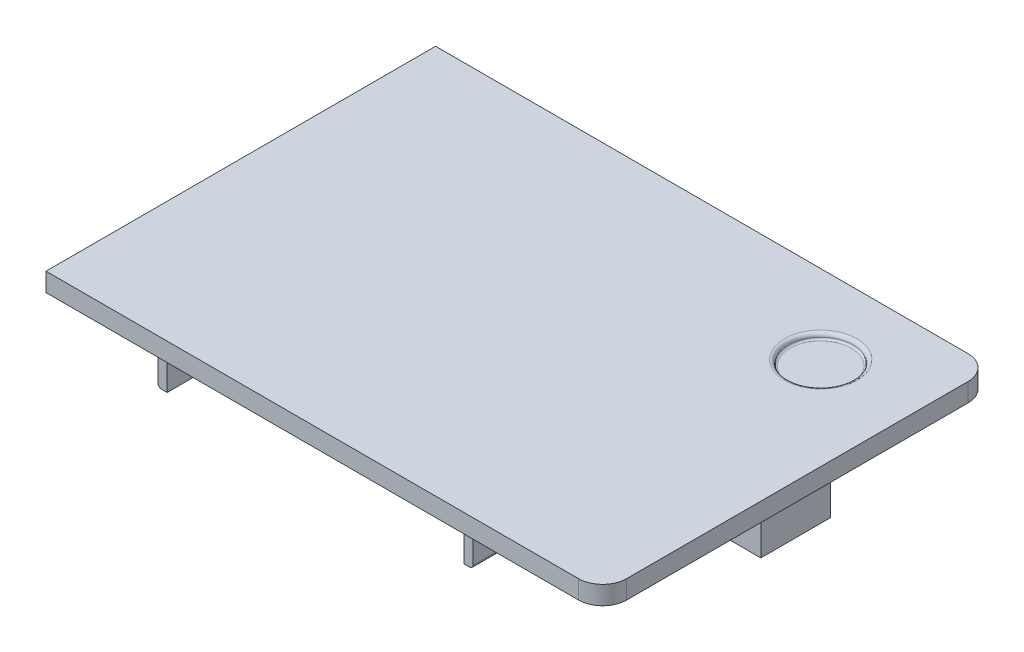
ISO-10303-21;
HEADER;
FILE_DESCRIPTION(('STEP AP214'),'2;1');
FILE_NAME('part.step','',(''),(''),'','','');
FILE_SCHEMA(('AUTOMOTIVE_DESIGN { 1 0 10303 214 1 1 1 1 }'));
ENDSEC;
DATA;
#1=APPLICATION_CONTEXT('core data for automotive mechanical design processes');
#2=APPLICATION_PROTOCOL_DEFINITION('international standard','automotive_design',2000,#1);
#3=PRODUCT_CONTEXT('',#1,'mechanical');
#4=PRODUCT('Part','Part','',(#3));
#5=PRODUCT_RELATED_PRODUCT_CATEGORY('part','',(#4));
#6=PRODUCT_DEFINITION_FORMATION('','',#4);
#7=PRODUCT_DEFINITION_CONTEXT('part definition',#1,'design');
#8=PRODUCT_DEFINITION('design','',#6,#7);
#9=PRODUCT_DEFINITION_SHAPE('','',#8);
#10=(LENGTH_UNIT() NAMED_UNIT(*) SI_UNIT(.MILLI.,.METRE.));
#11=(NAMED_UNIT(*) PLANE_ANGLE_UNIT() SI_UNIT($,.RADIAN.));
#12=(NAMED_UNIT(*) SI_UNIT($,.STERADIAN.) SOLID_ANGLE_UNIT());
#13=UNCERTAINTY_MEASURE_WITH_UNIT(LENGTH_MEASURE(1.E-05),#10,'distance_accuracy_value','');
#14=(GEOMETRIC_REPRESENTATION_CONTEXT(3) GLOBAL_UNCERTAINTY_ASSIGNED_CONTEXT((#13)) GLOBAL_UNIT_ASSIGNED_CONTEXT((#10,
#11,#12)) REPRESENTATION_CONTEXT('',''));
#15=CARTESIAN_POINT('',(0.,0.,0.));
#16=DIRECTION('',(0.,0.,1.));
#17=DIRECTION('',(1.,0.,0.));
#18=AXIS2_PLACEMENT_3D('',#15,#16,#17);
#19=CARTESIAN_POINT('',(-230.407229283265,-38.1,266.7));
#20=DIRECTION('',(1.,0.,0.));
#21=DIRECTION('',(0.,0.,-1.));
#22=AXIS2_PLACEMENT_3D('',#19,#20,#21);
#23=PLANE('',#22);
#24=DIRECTION('',(0.,-1.,0.));
#25=VECTOR('',#24,1.);
#26=CARTESIAN_POINT('',(-230.407229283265,0.,264.16));
#27=LINE('',#26,#25);
#28=CARTESIAN_POINT('',(-230.407229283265,0.,264.16));
#29=VERTEX_POINT('',#28);
#30=CARTESIAN_POINT('',(-230.407229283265,-33.02,264.16));
#31=VERTEX_POINT('',#30);
#32=EDGE_CURVE('E487',#29,#31,#27,.T.);
#33=ORIENTED_EDGE('',*,*,#32,.F.);
#34=DIRECTION('',(0.,0.,-1.));
#35=VECTOR('',#34,1.);
#36=CARTESIAN_POINT('',(-230.407229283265,0.,266.7));
#37=LINE('',#36,#35);
#38=CARTESIAN_POINT('',(-230.407229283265,0.,106.68));
#39=VERTEX_POINT('',#38);
#40=EDGE_CURVE('E266',#29,#39,#37,.T.);
#41=ORIENTED_EDGE('',*,*,#40,.T.);
#42=DIRECTION('',(0.,1.,0.));
#43=VECTOR('',#42,1.);
#44=CARTESIAN_POINT('',(-230.407229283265,-38.1,106.68));
#45=LINE('',#44,#43);
#46=CARTESIAN_POINT('',(-230.407229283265,-33.02,106.68));
#47=VERTEX_POINT('',#46);
#48=EDGE_CURVE('E350',#39,#47,#45,.F.);
#49=ORIENTED_EDGE('',*,*,#48,.T.);
#50=DIRECTION('',(0.,0.,-1.));
#51=VECTOR('',#50,1.);
#52=CARTESIAN_POINT('',(-230.407229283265,-33.02,266.7));
#53=LINE('',#52,#51);
#54=EDGE_CURVE('E347',#47,#31,#53,.F.);
#55=ORIENTED_EDGE('',*,*,#54,.T.);
#56=EDGE_LOOP('',(#33,#41,#49,#55));
#57=FACE_BOUND('',#56,.T.);
#58=ADVANCED_FACE('F37',(#57),#23,.F.);
#59=CARTESIAN_POINT('',(201.392770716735,-38.1,101.6));
#60=DIRECTION('',(-1.,0.,0.));
#61=DIRECTION('',(0.,0.,1.));
#62=AXIS2_PLACEMENT_3D('',#59,#60,#61);
#63=PLANE('',#62);
#64=DIRECTION('',(0.,1.,0.));
#65=VECTOR('',#64,1.);
#66=CARTESIAN_POINT('',(201.392770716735,-33.02,264.16));
#67=LINE('',#66,#65);
#68=CARTESIAN_POINT('',(201.392770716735,-33.02,264.16));
#69=VERTEX_POINT('',#68);
#70=CARTESIAN_POINT('',(201.392770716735,0.,264.16));
#71=VERTEX_POINT('',#70);
#72=EDGE_CURVE('E483',#69,#71,#67,.T.);
#73=ORIENTED_EDGE('',*,*,#72,.F.);
#74=DIRECTION('',(0.,0.,1.));
#75=VECTOR('',#74,1.);
#76=CARTESIAN_POINT('',(201.392770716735,-33.02,101.6));
#77=LINE('',#76,#75);
#78=CARTESIAN_POINT('',(201.392770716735,-33.02,106.68));
#79=VERTEX_POINT('',#78);
#80=EDGE_CURVE('E352',#69,#79,#77,.F.);
#81=ORIENTED_EDGE('',*,*,#80,.T.);
#82=DIRECTION('',(0.,1.,0.));
#83=VECTOR('',#82,1.);
#84=CARTESIAN_POINT('',(201.392770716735,-38.1,106.68));
#85=LINE('',#84,#83);
#86=CARTESIAN_POINT('',(201.392770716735,0.,106.68));
#87=VERTEX_POINT('',#86);
#88=EDGE_CURVE('E354',#79,#87,#85,.T.);
#89=ORIENTED_EDGE('',*,*,#88,.T.);
#90=DIRECTION('',(0.,0.,1.));
#91=VECTOR('',#90,1.);
#92=CARTESIAN_POINT('',(201.392770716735,0.,101.6));
#93=LINE('',#92,#91);
#94=EDGE_CURVE('E272',#87,#71,#93,.T.);
#95=ORIENTED_EDGE('',*,*,#94,.T.);
#96=EDGE_LOOP('',(#73,#81,#89,#95));
#97=FACE_BOUND('',#96,.T.);
#98=ADVANCED_FACE('F551',(#97),#63,.F.);
#99=CARTESIAN_POINT('',(188.692770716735,-38.1,114.3));
#100=DIRECTION('',(1.,0.,0.));
#101=DIRECTION('',(0.,0.,-1.));
#102=AXIS2_PLACEMENT_3D('',#99,#100,#101);
#103=PLANE('',#102);
#104=DIRECTION('',(0.,-1.,0.));
#105=VECTOR('',#104,1.);
#106=CARTESIAN_POINT('',(188.692770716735,0.,264.16));
#107=LINE('',#106,#105);
#108=CARTESIAN_POINT('',(188.692770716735,0.,264.16));
#109=VERTEX_POINT('',#108);
#110=CARTESIAN_POINT('',(188.692770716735,-38.1,264.16));
#111=VERTEX_POINT('',#110);
#112=EDGE_CURVE('E477',#109,#111,#107,.T.);
#113=ORIENTED_EDGE('',*,*,#112,.F.);
#114=DIRECTION('',(0.,0.,-1.));
#115=VECTOR('',#114,1.);
#116=CARTESIAN_POINT('',(188.692770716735,0.,114.3));
#117=LINE('',#116,#115);
#118=CARTESIAN_POINT('',(188.692770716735,0.,114.3));
#119=VERTEX_POINT('',#118);
#120=EDGE_CURVE('E275',#109,#119,#117,.T.);
#121=ORIENTED_EDGE('',*,*,#120,.T.);
#122=DIRECTION('',(0.,1.,0.));
#123=VECTOR('',#122,1.);
#124=CARTESIAN_POINT('',(188.692770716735,-38.1,114.3));
#125=LINE('',#124,#123);
#126=CARTESIAN_POINT('',(188.692770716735,-38.1,114.3));
#127=VERTEX_POINT('',#126);
#128=EDGE_CURVE('E284',#127,#119,#125,.T.);
#129=ORIENTED_EDGE('',*,*,#128,.F.);
#130=DIRECTION('',(0.,0.,-1.));
#131=VECTOR('',#130,1.);
#132=CARTESIAN_POINT('',(188.692770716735,-38.1,114.3));
#133=LINE('',#132,#131);
#134=EDGE_CURVE('E257',#111,#127,#133,.T.);
#135=ORIENTED_EDGE('',*,*,#134,.F.);
#136=EDGE_LOOP('',(#113,#121,#129,#135));
#137=FACE_BOUND('',#136,.T.);
#138=ADVANCED_FACE('F553',(#137),#103,.F.);
#139=CARTESIAN_POINT('',(-217.707229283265,-38.1,266.7));
#140=DIRECTION('',(-1.,0.,0.));
#141=DIRECTION('',(0.,0.,1.));
#142=AXIS2_PLACEMENT_3D('',#139,#140,#141);
#143=PLANE('',#142);
#144=DIRECTION('',(0.,1.,0.));
#145=VECTOR('',#144,1.);
#146=CARTESIAN_POINT('',(-217.707229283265,-38.1,264.16));
#147=LINE('',#146,#145);
#148=CARTESIAN_POINT('',(-217.707229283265,-38.1,264.16));
#149=VERTEX_POINT('',#148);
#150=CARTESIAN_POINT('',(-217.707229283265,0.,264.16));
#151=VERTEX_POINT('',#150);
#152=EDGE_CURVE('E471',#149,#151,#147,.T.);
#153=ORIENTED_EDGE('',*,*,#152,.F.);
#154=DIRECTION('',(0.,0.,1.));
#155=VECTOR('',#154,1.);
#156=CARTESIAN_POINT('',(-217.707229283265,-38.1,266.7));
#157=LINE('',#156,#155);
#158=CARTESIAN_POINT('',(-217.707229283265,-38.1,114.3));
#159=VERTEX_POINT('',#158);
#160=EDGE_CURVE('E262',#159,#149,#157,.T.);
#161=ORIENTED_EDGE('',*,*,#160,.F.);
#162=DIRECTION('',(0.,1.,0.));
#163=VECTOR('',#162,1.);
#164=CARTESIAN_POINT('',(-217.707229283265,-38.1,114.3));
#165=LINE('',#164,#163);
#166=CARTESIAN_POINT('',(-217.707229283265,0.,114.3));
#167=VERTEX_POINT('',#166);
#168=EDGE_CURVE('E265',#159,#167,#165,.T.);
#169=ORIENTED_EDGE('',*,*,#168,.T.);
#170=DIRECTION('',(0.,0.,1.));
#171=VECTOR('',#170,1.);
#172=CARTESIAN_POINT('',(-217.707229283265,0.,266.7));
#173=LINE('',#172,#171);
#174=EDGE_CURVE('E260',#167,#151,#173,.T.);
#175=ORIENTED_EDGE('',*,*,#174,.T.);
#176=EDGE_LOOP('',(#153,#161,#169,#175));
#177=FACE_BOUND('',#176,.T.);
#178=ADVANCED_FACE('F499',(#177),#143,.F.);
#179=CARTESIAN_POINT('',(0.,-38.1,0.));
#180=DIRECTION('',(0.,1.,0.));
#181=DIRECTION('',(0.,0.,1.));
#182=AXIS2_PLACEMENT_3D('',#179,#180,#181);
#183=PLANE('',#182);
#184=DIRECTION('',(1.,0.,0.));
#185=VECTOR('',#184,1.);
#186=CARTESIAN_POINT('',(188.692770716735,-38.1,264.16));
#187=LINE('',#186,#185);
#188=CARTESIAN_POINT('',(196.312770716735,-38.1,264.16));
#189=VERTEX_POINT('',#188);
#190=EDGE_CURVE('E65',#111,#189,#187,.T.);
#191=ORIENTED_EDGE('',*,*,#190,.F.);
#192=ORIENTED_EDGE('',*,*,#134,.T.);
#193=DIRECTION('',(-1.,0.,0.));
#194=VECTOR('',#193,1.);
#195=CARTESIAN_POINT('',(-217.707229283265,-38.1,114.3));
#196=LINE('',#195,#194);
#197=EDGE_CURVE('E259',#127,#159,#196,.T.);
#198=ORIENTED_EDGE('',*,*,#197,.T.);
#199=ORIENTED_EDGE('',*,*,#160,.T.);
#200=DIRECTION('',(1.,0.,0.));
#201=VECTOR('',#200,1.);
#202=CARTESIAN_POINT('',(-225.327229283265,-38.1,264.16));
#203=LINE('',#202,#201);
#204=CARTESIAN_POINT('',(-225.327229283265,-38.1,264.16));
#205=VERTEX_POINT('',#204);
#206=EDGE_CURVE('E479',#205,#149,#203,.T.);
#207=ORIENTED_EDGE('',*,*,#206,.F.);
#208=DIRECTION('',(0.,0.,-1.));
#209=VECTOR('',#208,1.);
#210=CARTESIAN_POINT('',(-225.327229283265,-38.1,0.));
#211=LINE('',#210,#209);
#212=CARTESIAN_POINT('',(-225.327229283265,-38.1,106.68));
#213=VERTEX_POINT('',#212);
#214=EDGE_CURVE('E361',#205,#213,#211,.T.);
#215=ORIENTED_EDGE('',*,*,#214,.T.);
#216=DIRECTION('',(1.,0.,0.));
#217=VECTOR('',#216,1.);
#218=CARTESIAN_POINT('',(0.,-38.1,106.68));
#219=LINE('',#218,#217);
#220=CARTESIAN_POINT('',(196.312770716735,-38.1,106.68));
#221=VERTEX_POINT('',#220);
#222=EDGE_CURVE('E359',#213,#221,#219,.T.);
#223=ORIENTED_EDGE('',*,*,#222,.T.);
#224=DIRECTION('',(0.,0.,1.));
#225=VECTOR('',#224,1.);
#226=CARTESIAN_POINT('',(196.312770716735,-38.1,0.));
#227=LINE('',#226,#225);
#228=EDGE_CURVE('E356',#221,#189,#227,.T.);
#229=ORIENTED_EDGE('',*,*,#228,.T.);
#230=EDGE_LOOP('',(#191,#192,#198,#199,#207,#215,#223,#229));
#231=FACE_BOUND('',#230,.T.);
#232=ADVANCED_FACE('F500',(#231),#183,.F.);
#233=CARTESIAN_POINT('',(196.312770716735,-33.02,0.));
#234=DIRECTION('',(0.,0.,1.));
#235=DIRECTION('',(1.,0.,0.));
#236=AXIS2_PLACEMENT_3D('',#233,#234,#235);
#237=CYLINDRICAL_SURFACE('',#236,5.08);
#238=ORIENTED_EDGE('',*,*,#80,.F.);
#239=CARTESIAN_POINT('',(196.312770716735,-33.02,264.16));
#240=DIRECTION('',(0.,0.,1.));
#241=DIRECTION('',(1.,0.,0.));
#242=AXIS2_PLACEMENT_3D('',#239,#240,#241);
#243=CIRCLE('',#242,5.08000000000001);
#244=EDGE_CURVE('E481',#189,#69,#243,.T.);
#245=ORIENTED_EDGE('',*,*,#244,.F.);
#246=ORIENTED_EDGE('',*,*,#228,.F.);
#247=CARTESIAN_POINT('',(196.312770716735,-33.02,106.68));
#248=DIRECTION('',(0.,0.,-1.));
#249=DIRECTION('',(-1.,0.,0.));
#250=AXIS2_PLACEMENT_3D('',#247,#248,#249);
#251=CIRCLE('',#250,5.08);
#252=EDGE_CURVE('E269',#79,#221,#251,.T.);
#253=ORIENTED_EDGE('',*,*,#252,.F.);
#254=EDGE_LOOP('',(#238,#245,#246,#253));
#255=FACE_BOUND('',#254,.T.);
#256=ADVANCED_FACE('F547',(#255),#237,.T.);
#257=CARTESIAN_POINT('',(-225.327229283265,-33.02,0.));
#258=DIRECTION('',(0.,0.,-1.));
#259=DIRECTION('',(-1.,0.,0.));
#260=AXIS2_PLACEMENT_3D('',#257,#258,#259);
#261=CYLINDRICAL_SURFACE('',#260,5.08);
#262=ORIENTED_EDGE('',*,*,#214,.F.);
#263=CARTESIAN_POINT('',(-225.327229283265,-33.02,264.16));
#264=DIRECTION('',(0.,0.,1.));
#265=DIRECTION('',(1.,0.,0.));
#266=AXIS2_PLACEMENT_3D('',#263,#264,#265);
#267=CIRCLE('',#266,5.07999999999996);
#268=EDGE_CURVE('E489',#31,#205,#267,.T.);
#269=ORIENTED_EDGE('',*,*,#268,.F.);
#270=ORIENTED_EDGE('',*,*,#54,.F.);
#271=CARTESIAN_POINT('',(-225.327229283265,-33.02,106.68));
#272=DIRECTION('',(0.,0.,-1.));
#273=DIRECTION('',(-1.,0.,0.));
#274=AXIS2_PLACEMENT_3D('',#271,#272,#273);
#275=CIRCLE('',#274,5.08);
#276=EDGE_CURVE('E374',#213,#47,#275,.T.);
#277=ORIENTED_EDGE('',*,*,#276,.F.);
#278=EDGE_LOOP('',(#262,#269,#270,#277));
#279=FACE_BOUND('',#278,.T.);
#280=ADVANCED_FACE('F518',(#279),#261,.T.);
#281=CARTESIAN_POINT('',(0.,0.,0.));
#282=DIRECTION('',(0.,-1.,0.));
#283=DIRECTION('',(0.,0.,-1.));
#284=AXIS2_PLACEMENT_3D('',#281,#282,#283);
#285=PLANE('',#284);
#286=DIRECTION('',(-1.,0.,0.));
#287=VECTOR('',#286,1.);
#288=CARTESIAN_POINT('',(381.,0.,47.5173340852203));
#289=LINE('',#288,#287);
#290=CARTESIAN_POINT('',(378.46,0.,47.5173340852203));
#291=VERTEX_POINT('',#290);
#292=CARTESIAN_POINT('',(-342.9,0.,47.5173340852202));
#293=VERTEX_POINT('',#292);
#294=EDGE_CURVE('E247',#291,#293,#289,.T.);
#295=ORIENTED_EDGE('',*,*,#294,.F.);
#296=DIRECTION('',(0.,0.,1.));
#297=VECTOR('',#296,1.);
#298=CARTESIAN_POINT('',(378.46,0.,47.5173340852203));
#299=LINE('',#298,#297);
#300=CARTESIAN_POINT('',(378.46,0.,-47.7326659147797));
#301=VERTEX_POINT('',#300);
#302=EDGE_CURVE('E233',#301,#291,#299,.T.);
#303=ORIENTED_EDGE('',*,*,#302,.F.);
#304=DIRECTION('',(1.,0.,0.));
#305=VECTOR('',#304,1.);
#306=CARTESIAN_POINT('',(381.,0.,-47.7326659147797));
#307=LINE('',#306,#305);
#308=CARTESIAN_POINT('',(-342.9,0.,-47.7326659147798));
#309=VERTEX_POINT('',#308);
#310=EDGE_CURVE('E232',#309,#301,#307,.T.);
#311=ORIENTED_EDGE('',*,*,#310,.F.);
#312=DIRECTION('',(0.,0.,-1.));
#313=VECTOR('',#312,1.);
#314=CARTESIAN_POINT('',(-342.9,0.,47.5173340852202));
#315=LINE('',#314,#313);
#316=EDGE_CURVE('E249',#293,#309,#315,.T.);
#317=ORIENTED_EDGE('',*,*,#316,.F.);
#318=EDGE_LOOP('',(#295,#303,#311,#317));
#319=FACE_BOUND('',#318,.T.);
#320=ORIENTED_EDGE('',*,*,#40,.F.);
#321=DIRECTION('',(-1.,0.,0.));
#322=VECTOR('',#321,1.);
#323=CARTESIAN_POINT('',(-217.707229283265,0.,264.16));
#324=LINE('',#323,#322);
#325=EDGE_CURVE('E474',#151,#29,#324,.T.);
#326=ORIENTED_EDGE('',*,*,#325,.F.);
#327=ORIENTED_EDGE('',*,*,#174,.F.);
#328=DIRECTION('',(-1.,0.,0.));
#329=VECTOR('',#328,1.);
#330=CARTESIAN_POINT('',(-217.707229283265,0.,114.3));
#331=LINE('',#330,#329);
#332=EDGE_CURVE('E277',#119,#167,#331,.T.);
#333=ORIENTED_EDGE('',*,*,#332,.F.);
#334=ORIENTED_EDGE('',*,*,#120,.F.);
#335=DIRECTION('',(-1.,0.,0.));
#336=VECTOR('',#335,1.);
#337=CARTESIAN_POINT('',(188.692770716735,0.,264.16));
#338=LINE('',#337,#336);
#339=EDGE_CURVE('E414',#71,#109,#338,.T.);
#340=ORIENTED_EDGE('',*,*,#339,.F.);
#341=ORIENTED_EDGE('',*,*,#94,.F.);
#342=CARTESIAN_POINT('',(196.312770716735,0.,106.68));
#343=DIRECTION('',(0.,-1.,0.));
#344=DIRECTION('',(0.,0.,-1.));
#345=AXIS2_PLACEMENT_3D('',#342,#343,#344);
#346=CIRCLE('',#345,5.08);
#347=CARTESIAN_POINT('',(196.312770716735,0.,101.6));
#348=VERTEX_POINT('',#347);
#349=EDGE_CURVE('E366',#87,#348,#346,.F.);
#350=ORIENTED_EDGE('',*,*,#349,.T.);
#351=DIRECTION('',(1.,0.,0.));
#352=VECTOR('',#351,1.);
#353=CARTESIAN_POINT('',(-230.407229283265,0.,101.6));
#354=LINE('',#353,#352);
#355=CARTESIAN_POINT('',(-225.327229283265,0.,101.6));
#356=VERTEX_POINT('',#355);
#357=EDGE_CURVE('E268',#356,#348,#354,.T.);
#358=ORIENTED_EDGE('',*,*,#357,.F.);
#359=CARTESIAN_POINT('',(-225.327229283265,0.,106.68));
#360=DIRECTION('',(0.,-1.,0.));
#361=DIRECTION('',(0.,0.,-1.));
#362=AXIS2_PLACEMENT_3D('',#359,#360,#361);
#363=CIRCLE('',#362,5.08);
#364=EDGE_CURVE('E363',#356,#39,#363,.F.);
#365=ORIENTED_EDGE('',*,*,#364,.T.);
#366=EDGE_LOOP('',(#320,#326,#327,#333,#334,#340,#341,#350,#358,#365));
#367=FACE_BOUND('',#366,.T.);
#368=CARTESIAN_POINT('',(347.98,0.,233.68));
#369=DIRECTION('',(0.,-1.,0.));
#370=DIRECTION('',(0.,0.,-1.));
#371=AXIS2_PLACEMENT_3D('',#368,#369,#370);
#372=CIRCLE('',#371,33.02);
#373=CARTESIAN_POINT('',(381.,0.,233.68));
#374=VERTEX_POINT('',#373);
#375=CARTESIAN_POINT('',(347.98,0.,266.7));
#376=VERTEX_POINT('',#375);
#377=EDGE_CURVE('E314',#374,#376,#372,.T.);
#378=ORIENTED_EDGE('',*,*,#377,.T.);
#379=DIRECTION('',(1.,0.,0.));
#380=VECTOR('',#379,1.);
#381=CARTESIAN_POINT('',(-381.,0.,266.7));
#382=LINE('',#381,#380);
#383=CARTESIAN_POINT('',(-381.,0.,266.7));
#384=VERTEX_POINT('',#383);
#385=EDGE_CURVE('E292',#384,#376,#382,.T.);
#386=ORIENTED_EDGE('',*,*,#385,.F.);
#387=DIRECTION('',(0.,0.,1.));
#388=VECTOR('',#387,1.);
#389=CARTESIAN_POINT('',(-381.,0.,266.7));
#390=LINE('',#389,#388);
#391=CARTESIAN_POINT('',(-381.,0.,-266.7));
#392=VERTEX_POINT('',#391);
#393=EDGE_CURVE('E303',#392,#384,#390,.T.);
#394=ORIENTED_EDGE('',*,*,#393,.F.);
#395=DIRECTION('',(-1.,0.,0.));
#396=VECTOR('',#395,1.);
#397=CARTESIAN_POINT('',(-381.,0.,-266.7));
#398=LINE('',#397,#396);
#399=CARTESIAN_POINT('',(347.98,0.,-266.7));
#400=VERTEX_POINT('',#399);
#401=EDGE_CURVE('E301',#400,#392,#398,.T.);
#402=ORIENTED_EDGE('',*,*,#401,.F.);
#403=CARTESIAN_POINT('',(347.98,0.,-233.68));
#404=DIRECTION('',(0.,-1.,0.));
#405=DIRECTION('',(0.,0.,-1.));
#406=AXIS2_PLACEMENT_3D('',#403,#404,#405);
#407=CIRCLE('',#406,33.02);
#408=CARTESIAN_POINT('',(381.,0.,-233.68));
#409=VERTEX_POINT('',#408);
#410=EDGE_CURVE('E317',#400,#409,#407,.T.);
#411=ORIENTED_EDGE('',*,*,#410,.T.);
#412=DIRECTION('',(0.,0.,-1.));
#413=VECTOR('',#412,1.);
#414=CARTESIAN_POINT('',(381.,0.,266.7));
#415=LINE('',#414,#413);
#416=EDGE_CURVE('E287',#374,#409,#415,.T.);
#417=ORIENTED_EDGE('',*,*,#416,.F.);
#418=EDGE_LOOP('',(#378,#386,#394,#402,#411,#417));
#419=FACE_BOUND('',#418,.T.);
#420=ADVANCED_FACE('F469',(#319,#367,#419),#285,.T.);
#421=CARTESIAN_POINT('',(381.,25.4,266.7));
#422=DIRECTION('',(-1.,0.,0.));
#423=DIRECTION('',(0.,0.,1.));
#424=AXIS2_PLACEMENT_3D('',#421,#422,#423);
#425=PLANE('',#424);
#426=ORIENTED_EDGE('',*,*,#416,.T.);
#427=DIRECTION('',(0.,-1.,0.));
#428=VECTOR('',#427,1.);
#429=CARTESIAN_POINT('',(381.,25.4,-233.68));
#430=LINE('',#429,#428);
#431=CARTESIAN_POINT('',(381.,25.4,-233.68));
#432=VERTEX_POINT('',#431);
#433=EDGE_CURVE('E323',#409,#432,#430,.F.);
#434=ORIENTED_EDGE('',*,*,#433,.T.);
#435=DIRECTION('',(0.,0.,-1.));
#436=VECTOR('',#435,1.);
#437=CARTESIAN_POINT('',(381.,25.4,266.7));
#438=LINE('',#437,#436);
#439=CARTESIAN_POINT('',(381.,25.4,233.68));
#440=VERTEX_POINT('',#439);
#441=EDGE_CURVE('E288',#440,#432,#438,.T.);
#442=ORIENTED_EDGE('',*,*,#441,.F.);
#443=DIRECTION('',(0.,-1.,0.));
#444=VECTOR('',#443,1.);
#445=CARTESIAN_POINT('',(381.,25.4,233.68));
#446=LINE('',#445,#444);
#447=EDGE_CURVE('E320',#440,#374,#446,.T.);
#448=ORIENTED_EDGE('',*,*,#447,.T.);
#449=EDGE_LOOP('',(#426,#434,#442,#448));
#450=FACE_BOUND('',#449,.T.);
#451=ADVANCED_FACE('F576',(#450),#425,.F.);
#452=CARTESIAN_POINT('',(-381.,25.4,-266.7));
#453=DIRECTION('',(0.,0.,1.));
#454=DIRECTION('',(1.,0.,0.));
#455=AXIS2_PLACEMENT_3D('',#452,#453,#454);
#456=PLANE('',#455);
#457=DIRECTION('',(-1.,0.,0.));
#458=VECTOR('',#457,1.);
#459=CARTESIAN_POINT('',(-381.,25.4,-266.7));
#460=LINE('',#459,#458);
#461=CARTESIAN_POINT('',(347.98,25.4,-266.7));
#462=VERTEX_POINT('',#461);
#463=CARTESIAN_POINT('',(-381.,25.4,-266.7));
#464=VERTEX_POINT('',#463);
#465=EDGE_CURVE('E291',#462,#464,#460,.T.);
#466=ORIENTED_EDGE('',*,*,#465,.F.);
#467=DIRECTION('',(0.,-1.,0.));
#468=VECTOR('',#467,1.);
#469=CARTESIAN_POINT('',(347.98,25.4,-266.7));
#470=LINE('',#469,#468);
#471=EDGE_CURVE('E311',#462,#400,#470,.T.);
#472=ORIENTED_EDGE('',*,*,#471,.T.);
#473=ORIENTED_EDGE('',*,*,#401,.T.);
#474=DIRECTION('',(0.,-1.,0.));
#475=VECTOR('',#474,1.);
#476=CARTESIAN_POINT('',(-381.,25.4,-266.7));
#477=LINE('',#476,#475);
#478=EDGE_CURVE('E308',#464,#392,#477,.T.);
#479=ORIENTED_EDGE('',*,*,#478,.F.);
#480=EDGE_LOOP('',(#466,#472,#473,#479));
#481=FACE_BOUND('',#480,.T.);
#482=ADVANCED_FACE('F583',(#481),#456,.F.);
#483=CARTESIAN_POINT('',(-381.,25.4,266.7));
#484=DIRECTION('',(1.,0.,0.));
#485=DIRECTION('',(0.,0.,-1.));
#486=AXIS2_PLACEMENT_3D('',#483,#484,#485);
#487=PLANE('',#486);
#488=ORIENTED_EDGE('',*,*,#393,.T.);
#489=DIRECTION('',(0.,-1.,0.));
#490=VECTOR('',#489,1.);
#491=CARTESIAN_POINT('',(-381.,25.4,266.7));
#492=LINE('',#491,#490);
#493=CARTESIAN_POINT('',(-381.,25.4,266.7));
#494=VERTEX_POINT('',#493);
#495=EDGE_CURVE('E299',#494,#384,#492,.T.);
#496=ORIENTED_EDGE('',*,*,#495,.F.);
#497=DIRECTION('',(0.,0.,1.));
#498=VECTOR('',#497,1.);
#499=CARTESIAN_POINT('',(-381.,25.4,266.7));
#500=LINE('',#499,#498);
#501=EDGE_CURVE('E294',#464,#494,#500,.T.);
#502=ORIENTED_EDGE('',*,*,#501,.F.);
#503=ORIENTED_EDGE('',*,*,#478,.T.);
#504=EDGE_LOOP('',(#488,#496,#502,#503));
#505=FACE_BOUND('',#504,.T.);
#506=ADVANCED_FACE('F579',(#505),#487,.F.);
#507=CARTESIAN_POINT('',(-381.,25.4,266.7));
#508=DIRECTION('',(0.,0.,-1.));
#509=DIRECTION('',(-1.,0.,0.));
#510=AXIS2_PLACEMENT_3D('',#507,#508,#509);
#511=PLANE('',#510);
#512=ORIENTED_EDGE('',*,*,#385,.T.);
#513=DIRECTION('',(0.,-1.,0.));
#514=VECTOR('',#513,1.);
#515=CARTESIAN_POINT('',(347.98,25.4,266.7));
#516=LINE('',#515,#514);
#517=CARTESIAN_POINT('',(347.98,25.4,266.7));
#518=VERTEX_POINT('',#517);
#519=EDGE_CURVE('E329',#376,#518,#516,.F.);
#520=ORIENTED_EDGE('',*,*,#519,.T.);
#521=DIRECTION('',(1.,0.,0.));
#522=VECTOR('',#521,1.);
#523=CARTESIAN_POINT('',(-381.,25.4,266.7));
#524=LINE('',#523,#522);
#525=EDGE_CURVE('E296',#494,#518,#524,.T.);
#526=ORIENTED_EDGE('',*,*,#525,.F.);
#527=ORIENTED_EDGE('',*,*,#495,.T.);
#528=EDGE_LOOP('',(#512,#520,#526,#527));
#529=FACE_BOUND('',#528,.T.);
#530=ADVANCED_FACE('F572',(#529),#511,.F.);
#531=CARTESIAN_POINT('',(0.,25.4,0.));
#532=DIRECTION('',(0.,-1.,0.));
#533=DIRECTION('',(0.,0.,-1.));
#534=AXIS2_PLACEMENT_3D('',#531,#532,#533);
#535=PLANE('',#534);
#536=CARTESIAN_POINT('',(254.,25.4,-158.889016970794));
#537=DIRECTION('',(0.,-1.,0.));
#538=DIRECTION('',(0.,0.,-1.));
#539=AXIS2_PLACEMENT_3D('',#536,#537,#538);
#540=CIRCLE('',#539,49.53);
#541=CARTESIAN_POINT('',(254.,25.4,-208.419016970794));
#542=VERTEX_POINT('',#541);
#543=EDGE_CURVE('E337',#542,#542,#540,.T.);
#544=ORIENTED_EDGE('',*,*,#543,.T.);
#545=EDGE_LOOP('',(#544));
#546=FACE_BOUND('',#545,.T.);
#547=ORIENTED_EDGE('',*,*,#441,.T.);
#548=CARTESIAN_POINT('',(347.98,25.4,-233.68));
#549=DIRECTION('',(0.,-1.,0.));
#550=DIRECTION('',(0.,0.,-1.));
#551=AXIS2_PLACEMENT_3D('',#548,#549,#550);
#552=CIRCLE('',#551,33.02);
#553=EDGE_CURVE('E327',#432,#462,#552,.F.);
#554=ORIENTED_EDGE('',*,*,#553,.T.);
#555=ORIENTED_EDGE('',*,*,#465,.T.);
#556=ORIENTED_EDGE('',*,*,#501,.T.);
#557=ORIENTED_EDGE('',*,*,#525,.T.);
#558=CARTESIAN_POINT('',(347.98,25.4,233.68));
#559=DIRECTION('',(0.,-1.,0.));
#560=DIRECTION('',(0.,0.,-1.));
#561=AXIS2_PLACEMENT_3D('',#558,#559,#560);
#562=CIRCLE('',#561,33.02);
#563=EDGE_CURVE('E325',#518,#440,#562,.F.);
#564=ORIENTED_EDGE('',*,*,#563,.T.);
#565=EDGE_LOOP('',(#547,#554,#555,#556,#557,#564));
#566=FACE_BOUND('',#565,.T.);
#567=ADVANCED_FACE('F568',(#546,#566),#535,.F.);
#568=CARTESIAN_POINT('',(347.98,25.4,-233.68));
#569=DIRECTION('',(0.,-1.,0.));
#570=DIRECTION('',(0.,0.,-1.));
#571=AXIS2_PLACEMENT_3D('',#568,#569,#570);
#572=CYLINDRICAL_SURFACE('',#571,33.02);
#573=ORIENTED_EDGE('',*,*,#553,.F.);
#574=ORIENTED_EDGE('',*,*,#433,.F.);
#575=ORIENTED_EDGE('',*,*,#410,.F.);
#576=ORIENTED_EDGE('',*,*,#471,.F.);
#577=EDGE_LOOP('',(#573,#574,#575,#576));
#578=FACE_BOUND('',#577,.T.);
#579=ADVANCED_FACE('F571',(#578),#572,.T.);
#580=CARTESIAN_POINT('',(347.98,25.4,233.68));
#581=DIRECTION('',(0.,-1.,0.));
#582=DIRECTION('',(0.,0.,-1.));
#583=AXIS2_PLACEMENT_3D('',#580,#581,#582);
#584=CYLINDRICAL_SURFACE('',#583,33.02);
#585=ORIENTED_EDGE('',*,*,#563,.F.);
#586=ORIENTED_EDGE('',*,*,#519,.F.);
#587=ORIENTED_EDGE('',*,*,#377,.F.);
#588=ORIENTED_EDGE('',*,*,#447,.F.);
#589=EDGE_LOOP('',(#585,#586,#587,#588));
#590=FACE_BOUND('',#589,.T.);
#591=ADVANCED_FACE('F566',(#590),#584,.T.);
#592=CARTESIAN_POINT('',(-230.407229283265,-38.1,101.6));
#593=DIRECTION('',(0.,0.,1.));
#594=DIRECTION('',(1.,0.,0.));
#595=AXIS2_PLACEMENT_3D('',#592,#593,#594);
#596=PLANE('',#595);
#597=DIRECTION('',(1.,0.,0.));
#598=VECTOR('',#597,1.);
#599=CARTESIAN_POINT('',(-230.407229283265,-33.02,101.6));
#600=LINE('',#599,#598);
#601=CARTESIAN_POINT('',(196.312770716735,-33.02,101.6));
#602=VERTEX_POINT('',#601);
#603=CARTESIAN_POINT('',(-225.327229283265,-33.02,101.6));
#604=VERTEX_POINT('',#603);
#605=EDGE_CURVE('E340',#602,#604,#600,.F.);
#606=ORIENTED_EDGE('',*,*,#605,.T.);
#607=DIRECTION('',(0.,1.,0.));
#608=VECTOR('',#607,1.);
#609=CARTESIAN_POINT('',(-225.327229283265,-38.1,101.6));
#610=LINE('',#609,#608);
#611=EDGE_CURVE('E344',#604,#356,#610,.T.);
#612=ORIENTED_EDGE('',*,*,#611,.T.);
#613=ORIENTED_EDGE('',*,*,#357,.T.);
#614=DIRECTION('',(0.,1.,0.));
#615=VECTOR('',#614,1.);
#616=CARTESIAN_POINT('',(196.312770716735,-38.1,101.6));
#617=LINE('',#616,#615);
#618=EDGE_CURVE('E342',#348,#602,#617,.F.);
#619=ORIENTED_EDGE('',*,*,#618,.T.);
#620=EDGE_LOOP('',(#606,#612,#613,#619));
#621=FACE_BOUND('',#620,.T.);
#622=ADVANCED_FACE('F528',(#621),#596,.F.);
#623=CARTESIAN_POINT('',(-217.707229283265,-38.1,114.3));
#624=DIRECTION('',(0.,0.,-1.));
#625=DIRECTION('',(-1.,0.,0.));
#626=AXIS2_PLACEMENT_3D('',#623,#624,#625);
#627=PLANE('',#626);
#628=ORIENTED_EDGE('',*,*,#332,.T.);
#629=ORIENTED_EDGE('',*,*,#168,.F.);
#630=ORIENTED_EDGE('',*,*,#197,.F.);
#631=ORIENTED_EDGE('',*,*,#128,.T.);
#632=EDGE_LOOP('',(#628,#629,#630,#631));
#633=FACE_BOUND('',#632,.T.);
#634=ADVANCED_FACE('F506',(#633),#627,.F.);
#635=CARTESIAN_POINT('',(254.,17.78,-158.889016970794));
#636=DIRECTION('',(0.,1.,0.));
#637=DIRECTION('',(0.,0.,1.));
#638=AXIS2_PLACEMENT_3D('',#635,#636,#637);
#639=PLANE('',#638);
#640=CARTESIAN_POINT('',(254.,17.78,-158.889016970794));
#641=DIRECTION('',(0.,1.,0.));
#642=DIRECTION('',(0.,0.,1.));
#643=AXIS2_PLACEMENT_3D('',#640,#641,#642);
#644=CIRCLE('',#643,41.91);
#645=CARTESIAN_POINT('',(254.,17.78,-116.979016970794));
#646=VERTEX_POINT('',#645);
#647=EDGE_CURVE('E331',#646,#646,#644,.T.);
#648=ORIENTED_EDGE('',*,*,#647,.T.);
#649=EDGE_LOOP('',(#648));
#650=FACE_BOUND('',#649,.T.);
#651=ADVANCED_FACE('F601',(#650),#639,.T.);
#652=CARTESIAN_POINT('',(254.,20.32,-158.889016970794));
#653=DIRECTION('',(0.,1.,0.));
#654=DIRECTION('',(0.,0.,1.));
#655=AXIS2_PLACEMENT_3D('',#652,#653,#654);
#656=TOROIDAL_SURFACE('',#655,41.91,2.54);
#657=CARTESIAN_POINT('',(254.,20.32,-158.889016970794));
#658=DIRECTION('',(0.,1.,0.));
#659=DIRECTION('',(0.,0.,1.));
#660=AXIS2_PLACEMENT_3D('',#657,#658,#659);
#661=CIRCLE('',#660,44.45);
#662=CARTESIAN_POINT('',(254.,20.32,-114.439016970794));
#663=VERTEX_POINT('',#662);
#664=EDGE_CURVE('E334',#663,#663,#661,.F.);
#665=ORIENTED_EDGE('',*,*,#664,.F.);
#666=EDGE_LOOP('',(#665));
#667=FACE_BOUND('',#666,.T.);
#668=ORIENTED_EDGE('',*,*,#647,.F.);
#669=EDGE_LOOP('',(#668));
#670=FACE_BOUND('',#669,.T.);
#671=ADVANCED_FACE('F597',(#667,#670),#656,.F.);
#672=CARTESIAN_POINT('',(254.,20.32,-158.889016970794));
#673=DIRECTION('',(0.,-1.,0.));
#674=DIRECTION('',(0.,0.,-1.));
#675=AXIS2_PLACEMENT_3D('',#672,#673,#674);
#676=TOROIDAL_SURFACE('',#675,49.53,5.08);
#677=ORIENTED_EDGE('',*,*,#543,.F.);
#678=EDGE_LOOP('',(#677));
#679=FACE_BOUND('',#678,.T.);
#680=ORIENTED_EDGE('',*,*,#664,.T.);
#681=EDGE_LOOP('',(#680));
#682=FACE_BOUND('',#681,.T.);
#683=ADVANCED_FACE('F600',(#679,#682),#676,.T.);
#684=CARTESIAN_POINT('',(196.312770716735,-38.1,106.68));
#685=DIRECTION('',(0.,1.,0.));
#686=DIRECTION('',(0.,0.,1.));
#687=AXIS2_PLACEMENT_3D('',#684,#685,#686);
#688=CYLINDRICAL_SURFACE('',#687,5.08);
#689=ORIENTED_EDGE('',*,*,#349,.F.);
#690=ORIENTED_EDGE('',*,*,#88,.F.);
#691=CARTESIAN_POINT('',(196.312770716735,-33.02,106.68));
#692=DIRECTION('',(0.,-1.,0.));
#693=DIRECTION('',(0.,0.,-1.));
#694=AXIS2_PLACEMENT_3D('',#691,#692,#693);
#695=CIRCLE('',#694,5.08);
#696=EDGE_CURVE('E380',#602,#79,#695,.T.);
#697=ORIENTED_EDGE('',*,*,#696,.F.);
#698=ORIENTED_EDGE('',*,*,#618,.F.);
#699=EDGE_LOOP('',(#689,#690,#697,#698));
#700=FACE_BOUND('',#699,.T.);
#701=ADVANCED_FACE('F535',(#700),#688,.T.);
#702=CARTESIAN_POINT('',(196.312770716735,-33.02,106.68));
#703=DIRECTION('',(0.,0.,1.));
#704=DIRECTION('',(1.,0.,0.));
#705=AXIS2_PLACEMENT_3D('',#702,#703,#704);
#706=SPHERICAL_SURFACE('',#705,5.08);
#707=ORIENTED_EDGE('',*,*,#696,.T.);
#708=ORIENTED_EDGE('',*,*,#252,.T.);
#709=CARTESIAN_POINT('',(196.312770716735,-33.02,106.68));
#710=DIRECTION('',(1.,0.,0.));
#711=DIRECTION('',(0.,0.,-1.));
#712=AXIS2_PLACEMENT_3D('',#709,#710,#711);
#713=CIRCLE('',#712,5.08);
#714=EDGE_CURVE('E377',#602,#221,#713,.F.);
#715=ORIENTED_EDGE('',*,*,#714,.F.);
#716=EDGE_LOOP('',(#707,#708,#715));
#717=FACE_BOUND('',#716,.T.);
#718=ADVANCED_FACE('F540',(#717),#706,.T.);
#719=CARTESIAN_POINT('',(0.,-33.02,106.68));
#720=DIRECTION('',(1.,0.,0.));
#721=DIRECTION('',(0.,0.,-1.));
#722=AXIS2_PLACEMENT_3D('',#719,#720,#721);
#723=CYLINDRICAL_SURFACE('',#722,5.08);
#724=ORIENTED_EDGE('',*,*,#714,.T.);
#725=ORIENTED_EDGE('',*,*,#222,.F.);
#726=CARTESIAN_POINT('',(-225.327229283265,-33.02,106.68));
#727=DIRECTION('',(-1.,0.,0.));
#728=DIRECTION('',(0.,0.,1.));
#729=AXIS2_PLACEMENT_3D('',#726,#727,#728);
#730=CIRCLE('',#729,5.08);
#731=EDGE_CURVE('E371',#604,#213,#730,.T.);
#732=ORIENTED_EDGE('',*,*,#731,.F.);
#733=ORIENTED_EDGE('',*,*,#605,.F.);
#734=EDGE_LOOP('',(#724,#725,#732,#733));
#735=FACE_BOUND('',#734,.T.);
#736=ADVANCED_FACE('F543',(#735),#723,.T.);
#737=CARTESIAN_POINT('',(-225.327229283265,-33.02,106.68));
#738=DIRECTION('',(0.,0.,1.));
#739=DIRECTION('',(1.,0.,0.));
#740=AXIS2_PLACEMENT_3D('',#737,#738,#739);
#741=SPHERICAL_SURFACE('',#740,5.08);
#742=ORIENTED_EDGE('',*,*,#731,.T.);
#743=ORIENTED_EDGE('',*,*,#276,.T.);
#744=CARTESIAN_POINT('',(-225.327229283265,-33.02,106.68));
#745=DIRECTION('',(0.,-1.,0.));
#746=DIRECTION('',(0.,0.,-1.));
#747=AXIS2_PLACEMENT_3D('',#744,#745,#746);
#748=CIRCLE('',#747,5.08);
#749=EDGE_CURVE('E256',#604,#47,#748,.F.);
#750=ORIENTED_EDGE('',*,*,#749,.F.);
#751=EDGE_LOOP('',(#742,#743,#750));
#752=FACE_BOUND('',#751,.T.);
#753=ADVANCED_FACE('F521',(#752),#741,.T.);
#754=CARTESIAN_POINT('',(-225.327229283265,-38.1,106.68));
#755=DIRECTION('',(0.,1.,0.));
#756=DIRECTION('',(0.,0.,1.));
#757=AXIS2_PLACEMENT_3D('',#754,#755,#756);
#758=CYLINDRICAL_SURFACE('',#757,5.08);
#759=ORIENTED_EDGE('',*,*,#749,.T.);
#760=ORIENTED_EDGE('',*,*,#48,.F.);
#761=ORIENTED_EDGE('',*,*,#364,.F.);
#762=ORIENTED_EDGE('',*,*,#611,.F.);
#763=EDGE_LOOP('',(#759,#760,#761,#762));
#764=FACE_BOUND('',#763,.T.);
#765=ADVANCED_FACE('F525',(#764),#758,.T.);
#766=CARTESIAN_POINT('',(381.,-44.45,47.5173340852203));
#767=DIRECTION('',(0.,0.,-1.));
#768=DIRECTION('',(-1.,0.,0.));
#769=AXIS2_PLACEMENT_3D('',#766,#767,#768);
#770=PLANE('',#769);
#771=DIRECTION('',(-1.,0.,0.));
#772=VECTOR('',#771,1.);
#773=CARTESIAN_POINT('',(381.,-44.45,47.5173340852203));
#774=LINE('',#773,#772);
#775=CARTESIAN_POINT('',(378.46,-44.45,47.5173340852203));
#776=VERTEX_POINT('',#775);
#777=CARTESIAN_POINT('',(-342.9,-44.45,47.5173340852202));
#778=VERTEX_POINT('',#777);
#779=EDGE_CURVE('E243',#776,#778,#774,.T.);
#780=ORIENTED_EDGE('',*,*,#779,.F.);
#781=DIRECTION('',(0.,-1.,0.));
#782=VECTOR('',#781,1.);
#783=CARTESIAN_POINT('',(378.46,-44.45,47.5173340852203));
#784=LINE('',#783,#782);
#785=EDGE_CURVE('E57',#291,#776,#784,.T.);
#786=ORIENTED_EDGE('',*,*,#785,.F.);
#787=ORIENTED_EDGE('',*,*,#294,.T.);
#788=DIRECTION('',(0.,1.,0.));
#789=VECTOR('',#788,1.);
#790=CARTESIAN_POINT('',(-342.9,-44.45,47.5173340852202));
#791=LINE('',#790,#789);
#792=EDGE_CURVE('E241',#778,#293,#791,.T.);
#793=ORIENTED_EDGE('',*,*,#792,.F.);
#794=EDGE_LOOP('',(#780,#786,#787,#793));
#795=FACE_BOUND('',#794,.T.);
#796=ADVANCED_FACE('F463',(#795),#770,.F.);
#797=CARTESIAN_POINT('',(-342.9,-44.45,47.5173340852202));
#798=DIRECTION('',(1.,0.,0.));
#799=DIRECTION('',(0.,0.,-1.));
#800=AXIS2_PLACEMENT_3D('',#797,#798,#799);
#801=PLANE('',#800);
#802=ORIENTED_EDGE('',*,*,#316,.T.);
#803=DIRECTION('',(0.,1.,0.));
#804=VECTOR('',#803,1.);
#805=CARTESIAN_POINT('',(-342.9,-44.45,-47.7326659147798));
#806=LINE('',#805,#804);
#807=CARTESIAN_POINT('',(-342.9,-44.45,-47.7326659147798));
#808=VERTEX_POINT('',#807);
#809=EDGE_CURVE('E239',#808,#309,#806,.T.);
#810=ORIENTED_EDGE('',*,*,#809,.F.);
#811=DIRECTION('',(0.,0.,-1.));
#812=VECTOR('',#811,1.);
#813=CARTESIAN_POINT('',(-342.9,-44.45,47.5173340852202));
#814=LINE('',#813,#812);
#815=EDGE_CURVE('E237',#778,#808,#814,.T.);
#816=ORIENTED_EDGE('',*,*,#815,.F.);
#817=ORIENTED_EDGE('',*,*,#792,.T.);
#818=EDGE_LOOP('',(#802,#810,#816,#817));
#819=FACE_BOUND('',#818,.T.);
#820=ADVANCED_FACE('F467',(#819),#801,.F.);
#821=CARTESIAN_POINT('',(381.,-44.45,-47.7326659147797));
#822=DIRECTION('',(0.,0.,1.));
#823=DIRECTION('',(1.,0.,0.));
#824=AXIS2_PLACEMENT_3D('',#821,#822,#823);
#825=PLANE('',#824);
#826=ORIENTED_EDGE('',*,*,#310,.T.);
#827=DIRECTION('',(0.,1.,0.));
#828=VECTOR('',#827,1.);
#829=CARTESIAN_POINT('',(378.46,0.,-47.7326659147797));
#830=LINE('',#829,#828);
#831=CARTESIAN_POINT('',(378.46,-44.45,-47.7326659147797));
#832=VERTEX_POINT('',#831);
#833=EDGE_CURVE('E220',#832,#301,#830,.T.);
#834=ORIENTED_EDGE('',*,*,#833,.F.);
#835=DIRECTION('',(1.,0.,0.));
#836=VECTOR('',#835,1.);
#837=CARTESIAN_POINT('',(381.,-44.45,-47.7326659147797));
#838=LINE('',#837,#836);
#839=EDGE_CURVE('E230',#808,#832,#838,.T.);
#840=ORIENTED_EDGE('',*,*,#839,.F.);
#841=ORIENTED_EDGE('',*,*,#809,.T.);
#842=EDGE_LOOP('',(#826,#834,#840,#841));
#843=FACE_BOUND('',#842,.T.);
#844=ADVANCED_FACE('F229',(#843),#825,.F.);
#845=CARTESIAN_POINT('',(0.,-44.45,0.));
#846=DIRECTION('',(0.,1.,0.));
#847=DIRECTION('',(0.,0.,1.));
#848=AXIS2_PLACEMENT_3D('',#845,#846,#847);
#849=PLANE('',#848);
#850=CARTESIAN_POINT('',(334.439151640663,-44.45,0.956485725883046));
#851=DIRECTION('',(0.,1.,0.));
#852=DIRECTION('',(0.,0.,1.));
#853=AXIS2_PLACEMENT_3D('',#850,#851,#852);
#854=CIRCLE('',#853,38.9408483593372);
#855=CARTESIAN_POINT('',(331.899151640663,-44.45,39.8144073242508));
#856=VERTEX_POINT('',#855);
#857=CARTESIAN_POINT('',(331.899151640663,-44.45,-37.9014358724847));
#858=VERTEX_POINT('',#857);
#859=EDGE_CURVE('E397',#856,#858,#854,.T.);
#860=ORIENTED_EDGE('',*,*,#859,.T.);
#861=DIRECTION('',(0.,0.,-1.));
#862=VECTOR('',#861,1.);
#863=CARTESIAN_POINT('',(331.899151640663,-44.45,0.));
#864=LINE('',#863,#862);
#865=EDGE_CURVE('E439',#858,#856,#864,.F.);
#866=ORIENTED_EDGE('',*,*,#865,.T.);
#867=EDGE_LOOP('',(#860,#866));
#868=FACE_BOUND('',#867,.T.);
#869=ORIENTED_EDGE('',*,*,#839,.T.);
#870=DIRECTION('',(0.,0.,-1.));
#871=VECTOR('',#870,1.);
#872=CARTESIAN_POINT('',(378.46,-44.45,-47.7326659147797));
#873=LINE('',#872,#871);
#874=EDGE_CURVE('E217',#776,#832,#873,.T.);
#875=ORIENTED_EDGE('',*,*,#874,.F.);
#876=ORIENTED_EDGE('',*,*,#779,.T.);
#877=ORIENTED_EDGE('',*,*,#815,.T.);
#878=EDGE_LOOP('',(#869,#875,#876,#877));
#879=FACE_BOUND('',#878,.T.);
#880=ADVANCED_FACE('F235',(#868,#879),#849,.F.);
#881=CARTESIAN_POINT('',(334.439151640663,-20.066,0.956485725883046));
#882=DIRECTION('',(0.,-1.,0.));
#883=DIRECTION('',(0.,0.,-1.));
#884=AXIS2_PLACEMENT_3D('',#881,#882,#883);
#885=CYLINDRICAL_SURFACE('',#884,33.8608483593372);
#886=DIRECTION('',(0.,-1.,0.));
#887=VECTOR('',#886,1.);
#888=CARTESIAN_POINT('',(334.439151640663,-20.066,34.8173340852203));
#889=LINE('',#888,#887);
#890=CARTESIAN_POINT('',(334.439151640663,-25.146,34.8173340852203));
#891=VERTEX_POINT('',#890);
#892=CARTESIAN_POINT('',(334.439151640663,-39.37,34.8173340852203));
#893=VERTEX_POINT('',#892);
#894=EDGE_CURVE('E456',#891,#893,#889,.T.);
#895=ORIENTED_EDGE('',*,*,#894,.F.);
#896=CARTESIAN_POINT('',(334.439151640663,-25.146,0.956485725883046));
#897=DIRECTION('',(0.,-1.,0.));
#898=DIRECTION('',(0.,0.,-1.));
#899=AXIS2_PLACEMENT_3D('',#896,#897,#898);
#900=CIRCLE('',#899,33.8608483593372);
#901=CARTESIAN_POINT('',(334.439151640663,-25.146,-32.9043626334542));
#902=VERTEX_POINT('',#901);
#903=EDGE_CURVE('E395',#891,#902,#900,.F.);
#904=ORIENTED_EDGE('',*,*,#903,.T.);
#905=DIRECTION('',(0.,-1.,0.));
#906=VECTOR('',#905,1.);
#907=CARTESIAN_POINT('',(334.439151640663,-20.066,-32.9043626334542));
#908=LINE('',#907,#906);
#909=CARTESIAN_POINT('',(334.439151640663,-39.37,-32.9043626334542));
#910=VERTEX_POINT('',#909);
#911=EDGE_CURVE('E250',#902,#910,#908,.T.);
#912=ORIENTED_EDGE('',*,*,#911,.T.);
#913=CARTESIAN_POINT('',(334.439151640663,-39.37,0.956485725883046));
#914=DIRECTION('',(0.,1.,0.));
#915=DIRECTION('',(0.,0.,1.));
#916=AXIS2_PLACEMENT_3D('',#913,#914,#915);
#917=CIRCLE('',#916,33.8608483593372);
#918=EDGE_CURVE('E392',#910,#893,#917,.F.);
#919=ORIENTED_EDGE('',*,*,#918,.T.);
#920=EDGE_LOOP('',(#895,#904,#912,#919));
#921=FACE_BOUND('',#920,.T.);
#922=ADVANCED_FACE('F455',(#921),#885,.F.);
#923=CARTESIAN_POINT('',(334.439151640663,-20.066,34.8173340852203));
#924=DIRECTION('',(-1.,0.,0.));
#925=DIRECTION('',(0.,0.,1.));
#926=AXIS2_PLACEMENT_3D('',#923,#924,#925);
#927=PLANE('',#926);
#928=CARTESIAN_POINT('',(334.439151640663,-39.37,39.8973340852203));
#929=DIRECTION('',(-1.,0.,0.));
#930=DIRECTION('',(0.,0.,1.));
#931=AXIS2_PLACEMENT_3D('',#928,#929,#930);
#932=CIRCLE('',#931,5.08);
#933=CARTESIAN_POINT('',(334.439151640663,-41.91,35.4979250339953));
#934=VERTEX_POINT('',#933);
#935=EDGE_CURVE('E399',#893,#934,#932,.T.);
#936=ORIENTED_EDGE('',*,*,#935,.T.);
#937=DIRECTION('',(0.,0.,-1.));
#938=VECTOR('',#937,1.);
#939=CARTESIAN_POINT('',(334.439151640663,-41.91,34.8173340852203));
#940=LINE('',#939,#938);
#941=CARTESIAN_POINT('',(334.439151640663,-41.91,-33.5849535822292));
#942=VERTEX_POINT('',#941);
#943=EDGE_CURVE('E404',#934,#942,#940,.T.);
#944=ORIENTED_EDGE('',*,*,#943,.T.);
#945=CARTESIAN_POINT('',(334.439151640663,-39.37,-37.9843626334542));
#946=DIRECTION('',(-1.,0.,0.));
#947=DIRECTION('',(0.,0.,1.));
#948=AXIS2_PLACEMENT_3D('',#945,#946,#947);
#949=CIRCLE('',#948,5.08);
#950=EDGE_CURVE('E402',#942,#910,#949,.T.);
#951=ORIENTED_EDGE('',*,*,#950,.T.);
#952=ORIENTED_EDGE('',*,*,#911,.F.);
#953=DIRECTION('',(0.,0.,-1.));
#954=VECTOR('',#953,1.);
#955=CARTESIAN_POINT('',(334.439151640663,-25.146,34.8173340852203));
#956=LINE('',#955,#954);
#957=EDGE_CURVE('E389',#902,#891,#956,.F.);
#958=ORIENTED_EDGE('',*,*,#957,.T.);
#959=ORIENTED_EDGE('',*,*,#894,.T.);
#960=EDGE_LOOP('',(#936,#944,#951,#952,#958,#959));
#961=FACE_BOUND('',#960,.T.);
#962=ADVANCED_FACE('F445',(#961),#927,.F.);
#963=CARTESIAN_POINT('',(334.439151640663,-20.066,0.956485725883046));
#964=DIRECTION('',(0.,-1.,0.));
#965=DIRECTION('',(0.,0.,-1.));
#966=AXIS2_PLACEMENT_3D('',#963,#964,#965);
#967=PLANE('',#966);
#968=CARTESIAN_POINT('',(334.439151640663,-20.066,0.956485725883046));
#969=DIRECTION('',(0.,-1.,0.));
#970=DIRECTION('',(0.,0.,-1.));
#971=AXIS2_PLACEMENT_3D('',#968,#969,#970);
#972=CIRCLE('',#971,28.7808483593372);
#973=CARTESIAN_POINT('',(339.519151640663,-20.066,-27.3724894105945));
#974=VERTEX_POINT('',#973);
#975=CARTESIAN_POINT('',(339.519151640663,-20.066,29.2854608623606));
#976=VERTEX_POINT('',#975);
#977=EDGE_CURVE('E368',#974,#976,#972,.T.);
#978=ORIENTED_EDGE('',*,*,#977,.T.);
#979=DIRECTION('',(0.,0.,-1.));
#980=VECTOR('',#979,1.);
#981=CARTESIAN_POINT('',(339.519151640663,-20.066,0.956485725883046));
#982=LINE('',#981,#980);
#983=EDGE_CURVE('E386',#976,#974,#982,.T.);
#984=ORIENTED_EDGE('',*,*,#983,.T.);
#985=EDGE_LOOP('',(#978,#984));
#986=FACE_BOUND('',#985,.T.);
#987=ADVANCED_FACE('F672',(#986),#967,.T.);
#988=CARTESIAN_POINT('',(334.439151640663,-25.146,0.956485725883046));
#989=DIRECTION('',(0.,-1.,0.));
#990=DIRECTION('',(0.,0.,-1.));
#991=AXIS2_PLACEMENT_3D('',#988,#989,#990);
#992=TOROIDAL_SURFACE('',#991,28.7808483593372,5.08);
#993=CARTESIAN_POINT('',(334.439151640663,-25.146,-32.9043626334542));
#994=CARTESIAN_POINT('',(334.439122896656,-25.0328363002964,-32.9043887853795));
#995=CARTESIAN_POINT('',(334.442931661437,-24.9196901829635,-32.9005825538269));
#996=CARTESIAN_POINT('',(334.458007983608,-24.6944760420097,-32.885502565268));
#997=CARTESIAN_POINT('',(334.469270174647,-24.5824073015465,-32.8742341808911));
#998=CARTESIAN_POINT('',(334.498917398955,-24.3611231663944,-32.8445470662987));
#999=CARTESIAN_POINT('',(334.51724412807,-24.2518920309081,-32.8261868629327));
#1000=CARTESIAN_POINT('',(334.560648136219,-24.0361587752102,-32.7826544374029));
#1001=CARTESIAN_POINT('',(334.585726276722,-23.9296570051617,-32.7574813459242));
#1002=CARTESIAN_POINT('',(334.642088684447,-23.7203893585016,-32.7008256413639));
#1003=CARTESIAN_POINT('',(334.673354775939,-23.6176135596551,-32.6693615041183));
#1004=CARTESIAN_POINT('',(334.74161916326,-23.4159922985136,-32.6005496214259));
#1005=CARTESIAN_POINT('',(334.778619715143,-23.3171484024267,-32.5631995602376));
#1006=CARTESIAN_POINT('',(334.897519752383,-23.0268898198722,-32.4429456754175));
#1007=CARTESIAN_POINT('',(334.987254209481,-22.8419771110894,-32.3519016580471));
#1008=CARTESIAN_POINT('',(335.221251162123,-22.4234516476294,-32.1133052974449));
#1009=CARTESIAN_POINT('',(335.373148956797,-22.1988595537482,-31.95754565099));
#1010=CARTESIAN_POINT('',(335.698740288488,-21.787440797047,-31.6208676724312));
#1011=CARTESIAN_POINT('',(335.872473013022,-21.600683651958,-31.4399040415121));
#1012=CARTESIAN_POINT('',(336.180980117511,-21.3127847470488,-31.1155521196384));
#1013=CARTESIAN_POINT('',(336.312259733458,-21.202588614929,-30.9766841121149));
#1014=CARTESIAN_POINT('',(336.579974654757,-20.9992051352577,-30.6915347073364));
#1015=CARTESIAN_POINT('',(336.716412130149,-20.906025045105,-30.5452501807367));
#1016=CARTESIAN_POINT('',(336.992932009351,-20.7356689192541,-30.246607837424));
#1017=CARTESIAN_POINT('',(337.133018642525,-20.6585124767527,-30.0942428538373));
#1018=CARTESIAN_POINT('',(337.415391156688,-20.5194073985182,-29.7847733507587));
#1019=CARTESIAN_POINT('',(337.557676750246,-20.4574567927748,-29.6276694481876));
#1020=CARTESIAN_POINT('',(337.851155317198,-20.3449380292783,-29.3010495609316));
#1021=CARTESIAN_POINT('',(338.002415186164,-20.2951629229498,-29.1313208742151));
#1022=CARTESIAN_POINT('',(338.30528373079,-20.2106529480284,-28.7885218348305));
#1023=CARTESIAN_POINT('',(338.456892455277,-20.1759203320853,-28.6154509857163));
#1024=CARTESIAN_POINT('',(338.910530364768,-20.0932427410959,-28.0929289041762));
#1025=CARTESIAN_POINT('',(339.21210208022,-20.0665484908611,-27.739356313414));
#1026=CARTESIAN_POINT('',(339.513004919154,-20.0660027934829,-27.3798357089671));
#1027=CARTESIAN_POINT('',(339.516078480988,-20.0660000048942,-27.3761626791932));
#1028=CARTESIAN_POINT('',(339.519151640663,-20.066,-27.3724894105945));
#1029=B_SPLINE_CURVE_WITH_KNOTS('',3,(#993,#994,#995,#996,#997,#998,#999,#1000,#1001,#1002,
#1003,#1004,#1005,#1006,#1007,#1008,#1009,#1010,#1011,#1012,#1013,#1014,#1015,#1016,#1017,#1018,
#1019,#1020,#1021,#1022,#1023,#1024,#1025,#1026,#1027,#1028),.UNSPECIFIED.,.F.,.F.,(4,2,2,2,2,2,
2,2,2,2,2,2,2,2,2,2,2,4),(0.,0.339335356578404,0.678426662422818,1.01477735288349,
1.35117098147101,1.68659081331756,2.02214294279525,2.69397631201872,3.62703847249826,
4.56179979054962,5.22275372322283,5.88398889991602,6.54602791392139,7.20798111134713,
7.90559738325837,8.60331808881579,9.99540646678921,10.0097745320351),.UNSPECIFIED.);
#1030=EDGE_CURVE('E405',#902,#974,#1029,.T.);
#1031=ORIENTED_EDGE('',*,*,#1030,.F.);
#1032=ORIENTED_EDGE('',*,*,#903,.F.);
#1033=CARTESIAN_POINT('',(334.439151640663,-25.146,34.8173340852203));
#1034=CARTESIAN_POINT('',(334.439122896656,-25.0328363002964,34.8173602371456));
#1035=CARTESIAN_POINT('',(334.442931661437,-24.9196901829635,34.813554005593));
#1036=CARTESIAN_POINT('',(334.458007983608,-24.6944760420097,34.7984740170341));
#1037=CARTESIAN_POINT('',(334.469270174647,-24.5824073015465,34.7872056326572));
#1038=CARTESIAN_POINT('',(334.498917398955,-24.3611231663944,34.7575185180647));
#1039=CARTESIAN_POINT('',(334.51724412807,-24.2518920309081,34.7391583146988));
#1040=CARTESIAN_POINT('',(334.560648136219,-24.0361587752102,34.695625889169));
#1041=CARTESIAN_POINT('',(334.585726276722,-23.9296570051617,34.6704527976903));
#1042=CARTESIAN_POINT('',(334.642088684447,-23.7203893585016,34.6137970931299));
#1043=CARTESIAN_POINT('',(334.673354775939,-23.6176135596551,34.5823329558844));
#1044=CARTESIAN_POINT('',(334.74161916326,-23.4159922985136,34.513521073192));
#1045=CARTESIAN_POINT('',(334.778619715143,-23.3171484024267,34.4761710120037));
#1046=CARTESIAN_POINT('',(334.897519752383,-23.0268898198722,34.3559171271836));
#1047=CARTESIAN_POINT('',(334.987254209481,-22.8419771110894,34.2648731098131));
#1048=CARTESIAN_POINT('',(335.221251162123,-22.4234516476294,34.026276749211));
#1049=CARTESIAN_POINT('',(335.373148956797,-22.1988595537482,33.8705171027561));
#1050=CARTESIAN_POINT('',(335.698740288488,-21.787440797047,33.5338391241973));
#1051=CARTESIAN_POINT('',(335.872473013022,-21.600683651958,33.3528754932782));
#1052=CARTESIAN_POINT('',(336.180980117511,-21.3127847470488,33.0285235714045));
#1053=CARTESIAN_POINT('',(336.312259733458,-21.202588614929,32.889655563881));
#1054=CARTESIAN_POINT('',(336.579974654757,-20.9992051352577,32.6045061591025));
#1055=CARTESIAN_POINT('',(336.716412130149,-20.906025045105,32.4582216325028));
#1056=CARTESIAN_POINT('',(336.992932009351,-20.735668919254,32.1595792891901));
#1057=CARTESIAN_POINT('',(337.133018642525,-20.6585124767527,32.0072143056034));
#1058=CARTESIAN_POINT('',(337.415391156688,-20.5194073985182,31.6977448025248));
#1059=CARTESIAN_POINT('',(337.557676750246,-20.4574567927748,31.5406408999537));
#1060=CARTESIAN_POINT('',(337.851155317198,-20.3449380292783,31.2140210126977));
#1061=CARTESIAN_POINT('',(338.002415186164,-20.2951629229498,31.0442923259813));
#1062=CARTESIAN_POINT('',(338.30528373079,-20.2106529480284,30.7014932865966));
#1063=CARTESIAN_POINT('',(338.456892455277,-20.1759203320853,30.5284224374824));
#1064=CARTESIAN_POINT('',(338.910530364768,-20.0932427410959,30.0059003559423));
#1065=CARTESIAN_POINT('',(339.21210208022,-20.0665484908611,29.6523277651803));
#1066=CARTESIAN_POINT('',(339.513004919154,-20.0660027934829,29.2928071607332));
#1067=CARTESIAN_POINT('',(339.516078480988,-20.0660000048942,29.2891341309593));
#1068=CARTESIAN_POINT('',(339.519151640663,-20.066,29.2854608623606));
#1069=B_SPLINE_CURVE_WITH_KNOTS('',3,(#1033,#1034,#1035,#1036,#1037,#1038,#1039,#1040,#1041,
#1042,#1043,#1044,#1045,#1046,#1047,#1048,#1049,#1050,#1051,#1052,#1053,#1054,#1055,#1056,#1057,
#1058,#1059,#1060,#1061,#1062,#1063,#1064,#1065,#1066,#1067,#1068),.UNSPECIFIED.,.F.,.F.,(4,2,2,
2,2,2,2,2,2,2,2,2,2,2,2,2,2,4),(0.,0.339335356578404,0.678426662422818,1.01477735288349,
1.35117098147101,1.68659081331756,2.02214294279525,2.69397631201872,3.62703847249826,
4.56179979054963,5.22275372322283,5.88398889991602,6.54602791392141,7.20798111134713,
7.90559738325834,8.6033180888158,9.9954064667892,10.0097745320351),.UNSPECIFIED.);
#1070=EDGE_CURVE('E413',#976,#891,#1069,.F.);
#1071=ORIENTED_EDGE('',*,*,#1070,.F.);
#1072=ORIENTED_EDGE('',*,*,#977,.F.);
#1073=EDGE_LOOP('',(#1031,#1032,#1071,#1072));
#1074=FACE_BOUND('',#1073,.T.);
#1075=ADVANCED_FACE('F420',(#1074),#992,.F.);
#1076=CARTESIAN_POINT('',(339.519151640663,-25.146,0.956485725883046));
#1077=DIRECTION('',(0.,0.,-1.));
#1078=DIRECTION('',(-1.,0.,0.));
#1079=AXIS2_PLACEMENT_3D('',#1076,#1077,#1078);
#1080=CYLINDRICAL_SURFACE('',#1079,5.08);
#1081=ORIENTED_EDGE('',*,*,#1070,.T.);
#1082=ORIENTED_EDGE('',*,*,#957,.F.);
#1083=ORIENTED_EDGE('',*,*,#1030,.T.);
#1084=ORIENTED_EDGE('',*,*,#983,.F.);
#1085=EDGE_LOOP('',(#1081,#1082,#1083,#1084));
#1086=FACE_BOUND('',#1085,.T.);
#1087=ADVANCED_FACE('F423',(#1086),#1080,.F.);
#1088=CARTESIAN_POINT('',(334.439151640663,-39.37,0.956485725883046));
#1089=DIRECTION('',(0.,1.,0.));
#1090=DIRECTION('',(0.,0.,1.));
#1091=AXIS2_PLACEMENT_3D('',#1088,#1089,#1090);
#1092=TOROIDAL_SURFACE('',#1091,38.9408483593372,5.08);
#1093=ORIENTED_EDGE('',*,*,#950,.F.);
#1094=CARTESIAN_POINT('',(334.439151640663,-41.91,-33.5849535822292));
#1095=CARTESIAN_POINT('',(334.439151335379,-42.0051352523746,-33.6398379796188));
#1096=CARTESIAN_POINT('',(334.433810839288,-42.0983431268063,-33.6978047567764));
#1097=CARTESIAN_POINT('',(334.413724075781,-42.2799220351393,-33.8189573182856));
#1098=CARTESIAN_POINT('',(334.399001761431,-42.3683047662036,-33.8821294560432));
#1099=CARTESIAN_POINT('',(334.361658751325,-42.5386229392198,-34.0121791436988));
#1100=CARTESIAN_POINT('',(334.339143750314,-42.6206275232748,-34.0789975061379));
#1101=CARTESIAN_POINT('',(334.287265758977,-42.7791795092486,-34.2164295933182));
#1102=CARTESIAN_POINT('',(334.25789767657,-42.8557227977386,-34.2870461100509));
#1103=CARTESIAN_POINT('',(334.187097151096,-43.0172987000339,-34.4452971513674));
#1104=CARTESIAN_POINT('',(334.144430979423,-43.1011396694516,-34.5335959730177));
#1105=CARTESIAN_POINT('',(334.05221055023,-43.2607141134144,-34.7137587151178));
#1106=CARTESIAN_POINT('',(334.002656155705,-43.3364474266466,-34.8056227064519));
#1107=CARTESIAN_POINT('',(333.844838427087,-43.5525178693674,-35.0866000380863));
#1108=CARTESIAN_POINT('',(333.727839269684,-43.6808284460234,-35.2802039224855));
#1109=CARTESIAN_POINT('',(333.516849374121,-43.8716703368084,-35.6134785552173));
#1110=CARTESIAN_POINT('',(333.426937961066,-43.9422713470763,-35.7513055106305));
#1111=CARTESIAN_POINT('',(333.241267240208,-44.0693945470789,-36.0295528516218));
#1112=CARTESIAN_POINT('',(333.145505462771,-44.1259107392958,-36.1699743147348));
#1113=CARTESIAN_POINT('',(332.85202545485,-44.2746753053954,-36.5933512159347));
#1114=CARTESIAN_POINT('',(332.647630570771,-44.3465564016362,-36.8791636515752));
#1115=CARTESIAN_POINT('',(332.351770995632,-44.4109543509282,-37.2863033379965));
#1116=CARTESIAN_POINT('',(332.263456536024,-44.4253251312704,-37.4070309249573));
#1117=CARTESIAN_POINT('',(332.086007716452,-44.4446869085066,-37.6485347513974));
#1118=CARTESIAN_POINT('',(331.99687429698,-44.449687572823,-37.7693108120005));
#1119=CARTESIAN_POINT('',(331.904811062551,-44.4499952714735,-37.8937848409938));
#1120=CARTESIAN_POINT('',(331.901981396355,-44.4500000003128,-37.8976104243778));
#1121=CARTESIAN_POINT('',(331.899151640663,-44.45,-37.9014358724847));
#1122=B_SPLINE_CURVE_WITH_KNOTS('',3,(#1094,#1095,#1096,#1097,#1098,#1099,#1100,#1101,#1102,
#1103,#1104,#1105,#1106,#1107,#1108,#1109,#1110,#1111,#1112,#1113,#1114,#1115,#1116,#1117,#1118,
#1119,#1120,#1121),.UNSPECIFIED.,.F.,.F.,(4,2,2,2,2,2,2,2,2,2,2,2,2,4),(0.,0.329120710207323,
0.657404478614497,0.981399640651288,1.30563631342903,1.69212492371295,2.07862122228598,
2.855569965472,3.3921623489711,3.92898283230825,4.99971824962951,5.45036579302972,
5.90054813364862,5.91482324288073),.UNSPECIFIED.);
#1123=EDGE_CURVE('E50',#942,#858,#1122,.T.);
#1124=ORIENTED_EDGE('',*,*,#1123,.T.);
#1125=ORIENTED_EDGE('',*,*,#859,.F.);
#1126=CARTESIAN_POINT('',(334.439151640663,-41.91,35.4979250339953));
#1127=CARTESIAN_POINT('',(334.439151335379,-42.0051352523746,35.5528094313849));
#1128=CARTESIAN_POINT('',(334.433810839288,-42.0983431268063,35.6107762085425));
#1129=CARTESIAN_POINT('',(334.413724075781,-42.2799220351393,35.7319287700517));
#1130=CARTESIAN_POINT('',(334.399001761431,-42.3683047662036,35.7951009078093));
#1131=CARTESIAN_POINT('',(334.361658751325,-42.5386229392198,35.9251505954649));
#1132=CARTESIAN_POINT('',(334.339143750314,-42.6206275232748,35.991968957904));
#1133=CARTESIAN_POINT('',(334.287265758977,-42.7791795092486,36.1294010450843));
#1134=CARTESIAN_POINT('',(334.25789767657,-42.8557227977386,36.200017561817));
#1135=CARTESIAN_POINT('',(334.187097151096,-43.0172987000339,36.3582686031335));
#1136=CARTESIAN_POINT('',(334.144430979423,-43.1011396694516,36.4465674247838));
#1137=CARTESIAN_POINT('',(334.05221055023,-43.2607141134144,36.6267301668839));
#1138=CARTESIAN_POINT('',(334.002656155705,-43.3364474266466,36.7185941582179));
#1139=CARTESIAN_POINT('',(333.844838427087,-43.5525178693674,36.9995714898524));
#1140=CARTESIAN_POINT('',(333.727839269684,-43.6808284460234,37.1931753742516));
#1141=CARTESIAN_POINT('',(333.516849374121,-43.8716703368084,37.5264500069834));
#1142=CARTESIAN_POINT('',(333.426937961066,-43.9422713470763,37.6642769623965));
#1143=CARTESIAN_POINT('',(333.241267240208,-44.0693945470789,37.9425243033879));
#1144=CARTESIAN_POINT('',(333.145505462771,-44.1259107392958,38.0829457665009));
#1145=CARTESIAN_POINT('',(332.85202545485,-44.2746753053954,38.5063226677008));
#1146=CARTESIAN_POINT('',(332.647630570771,-44.3465564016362,38.7921351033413));
#1147=CARTESIAN_POINT('',(332.351770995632,-44.4109543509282,39.1992747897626));
#1148=CARTESIAN_POINT('',(332.263456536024,-44.4253251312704,39.3200023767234));
#1149=CARTESIAN_POINT('',(332.086007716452,-44.4446869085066,39.5615062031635));
#1150=CARTESIAN_POINT('',(331.99687429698,-44.449687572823,39.6822822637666));
#1151=CARTESIAN_POINT('',(331.904811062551,-44.4499952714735,39.8067562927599));
#1152=CARTESIAN_POINT('',(331.901981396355,-44.4500000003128,39.8105818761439));
#1153=CARTESIAN_POINT('',(331.899151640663,-44.45,39.8144073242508));
#1154=B_SPLINE_CURVE_WITH_KNOTS('',3,(#1126,#1127,#1128,#1129,#1130,#1131,#1132,#1133,#1134,
#1135,#1136,#1137,#1138,#1139,#1140,#1141,#1142,#1143,#1144,#1145,#1146,#1147,#1148,#1149,#1150,
#1151,#1152,#1153),.UNSPECIFIED.,.F.,.F.,(4,2,2,2,2,2,2,2,2,2,2,2,2,4),(0.,0.329120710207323,
0.657404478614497,0.981399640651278,1.30563631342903,1.69212492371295,2.07862122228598,
2.855569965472,3.3921623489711,3.92898283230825,4.99971824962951,5.45036579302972,
5.90054813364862,5.91482324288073),.UNSPECIFIED.);
#1155=EDGE_CURVE('E11',#856,#934,#1154,.F.);
#1156=ORIENTED_EDGE('',*,*,#1155,.T.);
#1157=ORIENTED_EDGE('',*,*,#935,.F.);
#1158=ORIENTED_EDGE('',*,*,#918,.F.);
#1159=EDGE_LOOP('',(#1093,#1124,#1125,#1156,#1157,#1158));
#1160=FACE_BOUND('',#1159,.T.);
#1161=ADVANCED_FACE('F426',(#1160),#1092,.T.);
#1162=CARTESIAN_POINT('',(331.899151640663,-41.91,34.8173340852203));
#1163=DIRECTION('',(0.,0.,-1.));
#1164=DIRECTION('',(-1.,0.,0.));
#1165=AXIS2_PLACEMENT_3D('',#1162,#1163,#1164);
#1166=CYLINDRICAL_SURFACE('',#1165,2.54);
#1167=ORIENTED_EDGE('',*,*,#1155,.F.);
#1168=ORIENTED_EDGE('',*,*,#865,.F.);
#1169=ORIENTED_EDGE('',*,*,#1123,.F.);
#1170=ORIENTED_EDGE('',*,*,#943,.F.);
#1171=EDGE_LOOP('',(#1167,#1168,#1169,#1170));
#1172=FACE_BOUND('',#1171,.T.);
#1173=ADVANCED_FACE('F39',(#1172),#1166,.T.);
#1174=CARTESIAN_POINT('',(-225.327229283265,-33.02,264.16));
#1175=DIRECTION('',(0.,0.,1.));
#1176=DIRECTION('',(1.,0.,0.));
#1177=AXIS2_PLACEMENT_3D('',#1174,#1175,#1176);
#1178=PLANE('',#1177);
#1179=ORIENTED_EDGE('',*,*,#152,.T.);
#1180=ORIENTED_EDGE('',*,*,#325,.T.);
#1181=ORIENTED_EDGE('',*,*,#32,.T.);
#1182=ORIENTED_EDGE('',*,*,#268,.T.);
#1183=ORIENTED_EDGE('',*,*,#206,.T.);
#1184=EDGE_LOOP('',(#1179,#1180,#1181,#1182,#1183));
#1185=FACE_BOUND('',#1184,.T.);
#1186=ADVANCED_FACE('F493',(#1185),#1178,.T.);
#1187=CARTESIAN_POINT('',(196.312770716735,-33.02,264.16));
#1188=DIRECTION('',(0.,0.,1.));
#1189=DIRECTION('',(1.,0.,0.));
#1190=AXIS2_PLACEMENT_3D('',#1187,#1188,#1189);
#1191=PLANE('',#1190);
#1192=ORIENTED_EDGE('',*,*,#112,.T.);
#1193=ORIENTED_EDGE('',*,*,#190,.T.);
#1194=ORIENTED_EDGE('',*,*,#244,.T.);
#1195=ORIENTED_EDGE('',*,*,#72,.T.);
#1196=ORIENTED_EDGE('',*,*,#339,.T.);
#1197=EDGE_LOOP('',(#1192,#1193,#1194,#1195,#1196));
#1198=FACE_BOUND('',#1197,.T.);
#1199=ADVANCED_FACE('F549',(#1198),#1191,.T.);
#1200=CARTESIAN_POINT('',(378.46,0.,0.));
#1201=DIRECTION('',(-1.,0.,0.));
#1202=DIRECTION('',(0.,0.,1.));
#1203=AXIS2_PLACEMENT_3D('',#1200,#1201,#1202);
#1204=PLANE('',#1203);
#1205=ORIENTED_EDGE('',*,*,#785,.T.);
#1206=ORIENTED_EDGE('',*,*,#874,.T.);
#1207=ORIENTED_EDGE('',*,*,#833,.T.);
#1208=ORIENTED_EDGE('',*,*,#302,.T.);
#1209=EDGE_LOOP('',(#1205,#1206,#1207,#1208));
#1210=FACE_BOUND('',#1209,.T.);
#1211=ADVANCED_FACE('F219',(#1210),#1204,.F.);
#1212=CLOSED_SHELL('',(#58,#98,#138,#178,#232,#256,#280,#420,#451,#482,#506,#530,#567,#579,#591,
#622,#634,#651,#671,#683,#701,#718,#736,#753,#765,#796,#820,#844,#880,#922,#962,#987,#1075,
#1087,#1161,#1173,#1186,#1199,#1211));
#1213=MANIFOLD_SOLID_BREP('B2',#1212);
#1214=ADVANCED_BREP_SHAPE_REPRESENTATION('',(#18,#1213),#14);
#1215=SHAPE_DEFINITION_REPRESENTATION(#9,#1214);
ENDSEC;
END-ISO-10303-21;
